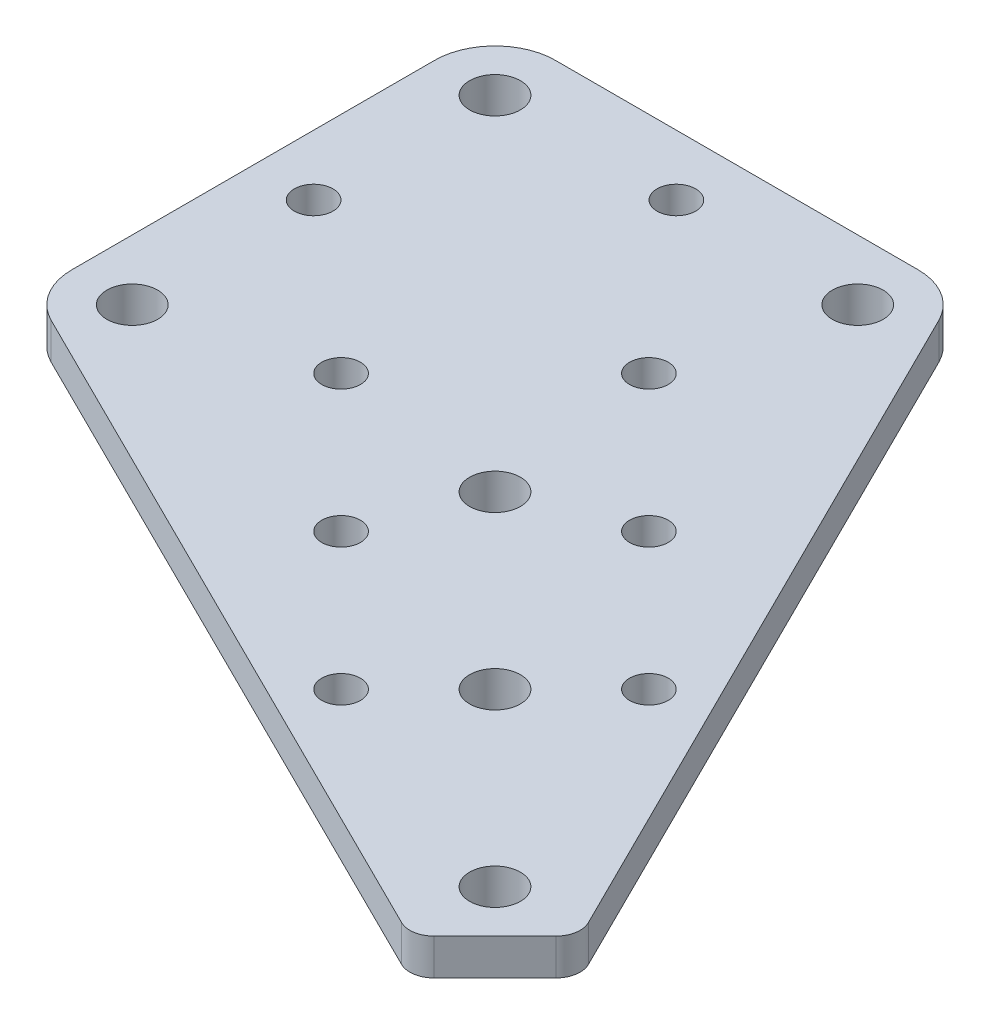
from build123d import *

# Parameters (mm, degrees)
SKETCH_1_R      = 2.1
SKETCH_1_R_2    = 1.6
EXTRUDE_1_DEPTH = 3
FILLET_1_R      = 2


with BuildPart() as part:
    # Sketch 1 → Extrude 1 (new body)
    with BuildSketch(Plane(origin=(0, 0, 0), x_dir=(1, 0, 0), z_dir=(0, 1, 0))):
        with BuildLine():
            Line((8, -43), (8, -13))
            ThreePointArc((8, -13), (9.464466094, -9.464466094), (13, -8))
            Line((13, -8), (43, -8))
            ThreePointArc((43, -8), (45.633719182, -8.749879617), (47.477449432, -10.774590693))
            Line((47.477449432, -10.774590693), (76.758838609, -69.687770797))
            Line((76.758838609, -69.687770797), (69.687770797, -76.758838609))
            Line((69.687770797, -76.758838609), (10.774590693, -47.477449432))
            ThreePointArc((10.774590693, -47.477449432), (8.749879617, -45.633719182), (8, -43))
        make_face()
        with Locations(Location((13, -13, 0), (0, 0, 270))):
            Circle(SKETCH_1_R, mode=Mode.SUBTRACT)
        with Locations(Location((43, -13, 0), (0, 0, 270))):
            Circle(SKETCH_1_R, mode=Mode.SUBTRACT)
        with Locations(Location((28, -13, 0), (0, 0, 270))):
            Circle(SKETCH_1_R_2, mode=Mode.SUBTRACT)
        with Locations(Location((13, -43, 0), (0, 0, 270))):
            Circle(SKETCH_1_R, mode=Mode.SUBTRACT)
        with Locations(Location((13, -28, 0), (0, 0, 270))):
            Circle(SKETCH_1_R_2, mode=Mode.SUBTRACT)
        with Locations(Location((41.40349955, -41.40349955, 0), (0, 0, 270))):
            Circle(SKETCH_1_R, mode=Mode.SUBTRACT)
        with Locations(Location((55.545635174, -55.545635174, 0), (0, 0, 270))):
            Circle(SKETCH_1_R, mode=Mode.SUBTRACT)
        with Locations(Location((69.687770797, -69.687770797, 0), (0, 0, 270))):
            Circle(SKETCH_1_R, mode=Mode.SUBTRACT)
        with Locations(Location((49.181674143, -61.909596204, 0), (0, 0, 270))):
            Circle(SKETCH_1_R_2, mode=Mode.SUBTRACT)
        with Locations(Location((37.867965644, -50.595887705, 0), (0, 0, 270))):
            Circle(SKETCH_1_R_2, mode=Mode.SUBTRACT)
        with Locations(Location((26.554257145, -39.282179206, 0), (0, 0, 270))):
            Circle(SKETCH_1_R_2, mode=Mode.SUBTRACT)
        with Locations(Location((50.595887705, -37.867965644, 0), (0, 0, 270))):
            Circle(SKETCH_1_R_2, mode=Mode.SUBTRACT)
        with Locations(Location((39.282179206, -26.554257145, 0), (0, 0, 270))):
            Circle(SKETCH_1_R_2, mode=Mode.SUBTRACT)
        with Locations(Location((61.909596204, -49.181674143, 0), (0, 0, 270))):
            Circle(SKETCH_1_R_2, mode=Mode.SUBTRACT)
    extrude(amount=EXTRUDE_1_DEPTH)

    # Fillet 1
    fillet_1_edges = [part.edges().sort_by_distance(p)[0] for p in [
        (69.687770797, 1.5, 76.758838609),
        (76.758838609, 1.5, 69.687770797),
    ]]
    fillet(fillet_1_edges, radius=FILLET_1_R)


solid = part.part
